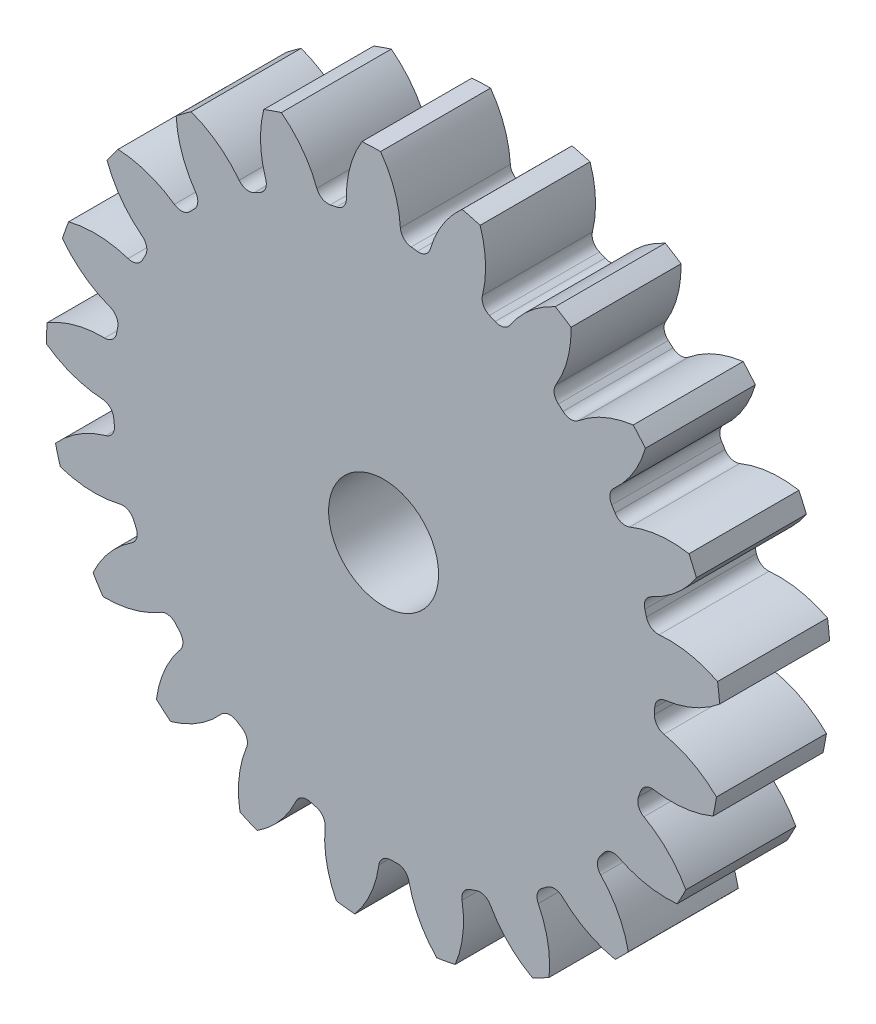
from build123d import *

# Parameters (mm, degrees)
SKETCH3_R         = 389.466666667
GEARBODY_DEPTH    = 127
TOOTHCUT_DEPTH    = 566.241159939
CIRPATTERN1_COUNT = 21
BOREDIA_R         = 63.5
BORE_DEPTH        = 12700


with BuildPart() as part:
    # Sketch3 → gearBody (new body)
    with BuildSketch(Plane.XY):
        Circle(SKETCH3_R)
    extrude(amount=GEARBODY_DEPTH)

    # Sketch2 → toothCut (cut, through all)
    with BuildSketch(Plane.XY):
        with BuildLine():
            ThreePointArc((312.878898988, -15.582009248), (313.037300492, -11.98553065), (313.154362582, -8.387469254))
            ThreePointArc((313.154362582, -8.387469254), (316.685087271, 0.461313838), (325.111752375, 4.906344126))
            ThreePointArc((325.111752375, 4.906344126), (359.377317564, 14.633068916), (389.466666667, 33.695314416))
            ThreePointArc((389.466666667, 33.695314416), (390.635327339, -14.956593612), (385.74998599, -63.376706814))
            ThreePointArc((385.74998599, -63.376706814), (357.20629608, -42.069527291), (323.784788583, -29.751208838))
            ThreePointArc((323.784788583, -29.751208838), (315.72267684, -24.674858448), (312.878898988, -15.582009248))
        make_face()
    toothcut = extrude(amount=TOOTHCUT_DEPTH, mode=Mode.SUBTRACT)

    # CirPattern1: toothCut ×21 about axis
    cirpattern1_axis = Axis((0, 0, 0), (0, 0, 1))
    for i in range(1, CIRPATTERN1_COUNT):
        add(toothcut.rotate(cirpattern1_axis, i * 360 / CIRPATTERN1_COUNT), mode=Mode.SUBTRACT)

    # boreDia → bore (cut, symmetric)
    with BuildSketch(Plane.XY):
        Circle(BOREDIA_R)
    extrude(amount=BORE_DEPTH, both=True, mode=Mode.SUBTRACT)


solid = part.part
